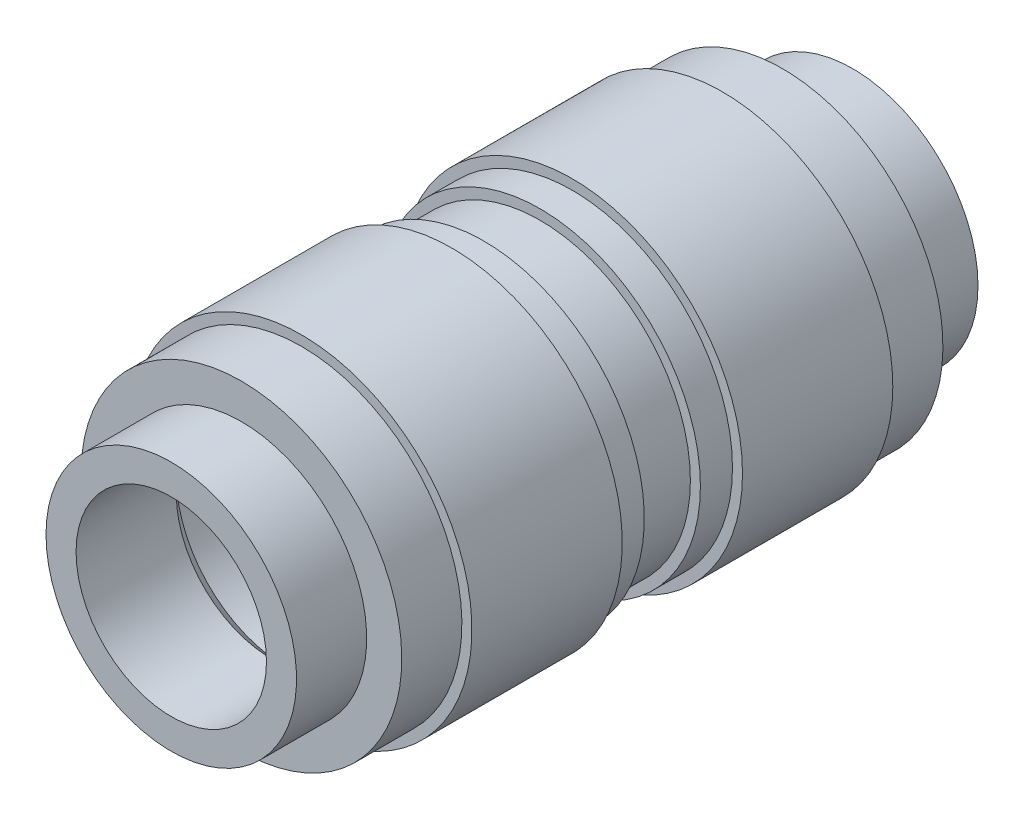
ISO-10303-21;
HEADER;
FILE_DESCRIPTION(('STEP AP214'),'2;1');
FILE_NAME('part.step','',(''),(''),'','','');
FILE_SCHEMA(('AUTOMOTIVE_DESIGN { 1 0 10303 214 1 1 1 1 }'));
ENDSEC;
DATA;
#1=APPLICATION_CONTEXT('core data for automotive mechanical design processes');
#2=APPLICATION_PROTOCOL_DEFINITION('international standard','automotive_design',2000,#1);
#3=PRODUCT_CONTEXT('',#1,'mechanical');
#4=PRODUCT('Part','Part','',(#3));
#5=PRODUCT_RELATED_PRODUCT_CATEGORY('part','',(#4));
#6=PRODUCT_DEFINITION_FORMATION('','',#4);
#7=PRODUCT_DEFINITION_CONTEXT('part definition',#1,'design');
#8=PRODUCT_DEFINITION('design','',#6,#7);
#9=PRODUCT_DEFINITION_SHAPE('','',#8);
#10=(LENGTH_UNIT() NAMED_UNIT(*) SI_UNIT(.MILLI.,.METRE.));
#11=(NAMED_UNIT(*) PLANE_ANGLE_UNIT() SI_UNIT($,.RADIAN.));
#12=(NAMED_UNIT(*) SI_UNIT($,.STERADIAN.) SOLID_ANGLE_UNIT());
#13=UNCERTAINTY_MEASURE_WITH_UNIT(LENGTH_MEASURE(1.E-05),#10,'distance_accuracy_value','');
#14=(GEOMETRIC_REPRESENTATION_CONTEXT(3) GLOBAL_UNCERTAINTY_ASSIGNED_CONTEXT((#13)) GLOBAL_UNIT_ASSIGNED_CONTEXT((#10,
#11,#12)) REPRESENTATION_CONTEXT('',''));
#15=CARTESIAN_POINT('',(0.,0.,0.));
#16=DIRECTION('',(0.,0.,1.));
#17=DIRECTION('',(1.,0.,0.));
#18=AXIS2_PLACEMENT_3D('',#15,#16,#17);
#19=CARTESIAN_POINT('',(0.,0.,-34.));
#20=DIRECTION('',(0.,0.,1.));
#21=DIRECTION('',(1.,0.,0.));
#22=AXIS2_PLACEMENT_3D('',#19,#20,#21);
#23=CYLINDRICAL_SURFACE('',#22,9.5);
#24=CARTESIAN_POINT('',(0.,0.,-34.));
#25=DIRECTION('',(0.,0.,1.));
#26=DIRECTION('',(1.,0.,0.));
#27=AXIS2_PLACEMENT_3D('',#24,#25,#26);
#28=CIRCLE('',#27,9.5);
#29=CARTESIAN_POINT('',(9.5,0.,-34.));
#30=VERTEX_POINT('',#29);
#31=EDGE_CURVE('E14',#30,#30,#28,.F.);
#32=ORIENTED_EDGE('',*,*,#31,.T.);
#33=EDGE_LOOP('',(#32));
#34=FACE_BOUND('',#33,.T.);
#35=CARTESIAN_POINT('',(0.,0.,-24.));
#36=DIRECTION('',(0.,0.,1.));
#37=DIRECTION('',(1.,0.,0.));
#38=AXIS2_PLACEMENT_3D('',#35,#36,#37);
#39=CIRCLE('',#38,9.5);
#40=CARTESIAN_POINT('',(9.5,0.,-24.));
#41=VERTEX_POINT('',#40);
#42=EDGE_CURVE('E26',#41,#41,#39,.F.);
#43=ORIENTED_EDGE('',*,*,#42,.F.);
#44=EDGE_LOOP('',(#43));
#45=FACE_BOUND('',#44,.T.);
#46=ADVANCED_FACE('F10',(#34,#45),#23,.F.);
#47=CARTESIAN_POINT('',(-12.65,-12.65,-34.));
#48=DIRECTION('',(0.,0.,1.));
#49=DIRECTION('',(1.,0.,0.));
#50=AXIS2_PLACEMENT_3D('',#47,#48,#49);
#51=PLANE('',#50);
#52=ORIENTED_EDGE('',*,*,#31,.F.);
#53=EDGE_LOOP('',(#52));
#54=FACE_BOUND('',#53,.T.);
#55=CARTESIAN_POINT('',(0.,0.,-34.));
#56=DIRECTION('',(0.,0.,1.));
#57=DIRECTION('',(1.,0.,0.));
#58=AXIS2_PLACEMENT_3D('',#55,#56,#57);
#59=CIRCLE('',#58,12.5);
#60=CARTESIAN_POINT('',(12.5,0.,-34.));
#61=VERTEX_POINT('',#60);
#62=EDGE_CURVE('E82',#61,#61,#59,.F.);
#63=ORIENTED_EDGE('',*,*,#62,.T.);
#64=EDGE_LOOP('',(#63));
#65=FACE_BOUND('',#64,.T.);
#66=ADVANCED_FACE('F95',(#54,#65),#51,.F.);
#67=CARTESIAN_POINT('',(0.,0.,-24.));
#68=DIRECTION('',(0.,0.,1.));
#69=DIRECTION('',(1.,0.,0.));
#70=AXIS2_PLACEMENT_3D('',#67,#68,#69);
#71=CONICAL_SURFACE('',#70,9.5,0.785398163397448);
#72=ORIENTED_EDGE('',*,*,#42,.T.);
#73=EDGE_LOOP('',(#72));
#74=FACE_BOUND('',#73,.T.);
#75=CARTESIAN_POINT('',(0.,0.,-22.5));
#76=DIRECTION('',(0.,0.,1.));
#77=DIRECTION('',(1.,0.,0.));
#78=AXIS2_PLACEMENT_3D('',#75,#76,#77);
#79=CIRCLE('',#78,11.);
#80=CARTESIAN_POINT('',(11.,0.,-22.5));
#81=VERTEX_POINT('',#80);
#82=EDGE_CURVE('E81',#81,#81,#79,.F.);
#83=ORIENTED_EDGE('',*,*,#82,.F.);
#84=EDGE_LOOP('',(#83));
#85=FACE_BOUND('',#84,.T.);
#86=ADVANCED_FACE('F97',(#74,#85),#71,.F.);
#87=CARTESIAN_POINT('',(0.,0.,-34.));
#88=DIRECTION('',(0.,0.,1.));
#89=DIRECTION('',(1.,0.,0.));
#90=AXIS2_PLACEMENT_3D('',#87,#88,#89);
#91=CYLINDRICAL_SURFACE('',#90,12.5);
#92=CARTESIAN_POINT('',(0.,0.,-27.));
#93=DIRECTION('',(0.,0.,1.));
#94=DIRECTION('',(1.,0.,0.));
#95=AXIS2_PLACEMENT_3D('',#92,#93,#94);
#96=CIRCLE('',#95,12.5);
#97=CARTESIAN_POINT('',(12.5,0.,-27.));
#98=VERTEX_POINT('',#97);
#99=EDGE_CURVE('E79',#98,#98,#96,.F.);
#100=ORIENTED_EDGE('',*,*,#99,.T.);
#101=EDGE_LOOP('',(#100));
#102=FACE_BOUND('',#101,.T.);
#103=ORIENTED_EDGE('',*,*,#62,.F.);
#104=EDGE_LOOP('',(#103));
#105=FACE_BOUND('',#104,.T.);
#106=ADVANCED_FACE('F102',(#102,#105),#91,.T.);
#107=CARTESIAN_POINT('',(0.,0.,-22.5));
#108=DIRECTION('',(0.,0.,1.));
#109=DIRECTION('',(1.,0.,0.));
#110=AXIS2_PLACEMENT_3D('',#107,#108,#109);
#111=CYLINDRICAL_SURFACE('',#110,11.);
#112=ORIENTED_EDGE('',*,*,#82,.T.);
#113=EDGE_LOOP('',(#112));
#114=FACE_BOUND('',#113,.T.);
#115=CARTESIAN_POINT('',(0.,0.,-5.50000000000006));
#116=DIRECTION('',(0.,0.,-1.));
#117=DIRECTION('',(-1.,0.,0.));
#118=AXIS2_PLACEMENT_3D('',#115,#116,#117);
#119=CIRCLE('',#118,11.);
#120=CARTESIAN_POINT('',(-11.,0.,-5.5));
#121=VERTEX_POINT('',#120);
#122=EDGE_CURVE('E78',#121,#121,#119,.T.);
#123=ORIENTED_EDGE('',*,*,#122,.F.);
#124=EDGE_LOOP('',(#123));
#125=FACE_BOUND('',#124,.T.);
#126=ADVANCED_FACE('F177',(#114,#125),#111,.F.);
#127=CARTESIAN_POINT('',(-16.192,-16.192,-27.));
#128=DIRECTION('',(0.,0.,1.));
#129=DIRECTION('',(1.,0.,0.));
#130=AXIS2_PLACEMENT_3D('',#127,#128,#129);
#131=PLANE('',#130);
#132=ORIENTED_EDGE('',*,*,#99,.F.);
#133=EDGE_LOOP('',(#132));
#134=FACE_BOUND('',#133,.T.);
#135=CARTESIAN_POINT('',(0.,0.,-27.));
#136=DIRECTION('',(0.,0.,1.));
#137=DIRECTION('',(0.,-1.,0.));
#138=AXIS2_PLACEMENT_3D('',#135,#136,#137);
#139=CIRCLE('',#138,16.);
#140=CARTESIAN_POINT('',(0.,-16.,-27.));
#141=VERTEX_POINT('',#140);
#142=EDGE_CURVE('E75',#141,#141,#139,.F.);
#143=ORIENTED_EDGE('',*,*,#142,.T.);
#144=EDGE_LOOP('',(#143));
#145=FACE_BOUND('',#144,.T.);
#146=ADVANCED_FACE('F175',(#134,#145),#131,.F.);
#147=CARTESIAN_POINT('',(0.,0.,-4.));
#148=DIRECTION('',(0.,0.,-1.));
#149=DIRECTION('',(-1.,0.,0.));
#150=AXIS2_PLACEMENT_3D('',#147,#148,#149);
#151=CONICAL_SURFACE('',#150,9.5,0.785398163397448);
#152=CARTESIAN_POINT('',(0.,0.,-4.));
#153=DIRECTION('',(0.,0.,1.));
#154=DIRECTION('',(1.,0.,0.));
#155=AXIS2_PLACEMENT_3D('',#152,#153,#154);
#156=CIRCLE('',#155,9.5);
#157=CARTESIAN_POINT('',(9.5,0.,-4.));
#158=VERTEX_POINT('',#157);
#159=EDGE_CURVE('E74',#158,#158,#156,.F.);
#160=ORIENTED_EDGE('',*,*,#159,.F.);
#161=EDGE_LOOP('',(#160));
#162=FACE_BOUND('',#161,.T.);
#163=ORIENTED_EDGE('',*,*,#122,.T.);
#164=EDGE_LOOP('',(#163));
#165=FACE_BOUND('',#164,.T.);
#166=ADVANCED_FACE('F171',(#162,#165),#151,.F.);
#167=CARTESIAN_POINT('',(0.,0.,-27.));
#168=DIRECTION('',(0.,0.,1.));
#169=DIRECTION('',(0.,-1.,0.));
#170=AXIS2_PLACEMENT_3D('',#167,#168,#169);
#171=CYLINDRICAL_SURFACE('',#170,16.);
#172=CARTESIAN_POINT('',(0.,0.,-21.));
#173=DIRECTION('',(0.,0.,1.));
#174=DIRECTION('',(0.,-1.,0.));
#175=AXIS2_PLACEMENT_3D('',#172,#173,#174);
#176=CIRCLE('',#175,16.);
#177=CARTESIAN_POINT('',(0.,-16.,-21.));
#178=VERTEX_POINT('',#177);
#179=EDGE_CURVE('E71',#178,#178,#176,.F.);
#180=ORIENTED_EDGE('',*,*,#179,.T.);
#181=EDGE_LOOP('',(#180));
#182=FACE_BOUND('',#181,.T.);
#183=ORIENTED_EDGE('',*,*,#142,.F.);
#184=EDGE_LOOP('',(#183));
#185=FACE_BOUND('',#184,.T.);
#186=ADVANCED_FACE('F167',(#182,#185),#171,.T.);
#187=CARTESIAN_POINT('',(0.,0.,-4.));
#188=DIRECTION('',(0.,0.,1.));
#189=DIRECTION('',(1.,0.,0.));
#190=AXIS2_PLACEMENT_3D('',#187,#188,#189);
#191=CYLINDRICAL_SURFACE('',#190,9.5);
#192=ORIENTED_EDGE('',*,*,#159,.T.);
#193=EDGE_LOOP('',(#192));
#194=FACE_BOUND('',#193,.T.);
#195=CARTESIAN_POINT('',(0.,0.,4.));
#196=DIRECTION('',(0.,0.,1.));
#197=DIRECTION('',(-1.,0.,0.));
#198=AXIS2_PLACEMENT_3D('',#195,#196,#197);
#199=CIRCLE('',#198,9.5);
#200=CARTESIAN_POINT('',(-9.5,0.,4.));
#201=VERTEX_POINT('',#200);
#202=EDGE_CURVE('E70',#201,#201,#199,.F.);
#203=ORIENTED_EDGE('',*,*,#202,.F.);
#204=EDGE_LOOP('',(#203));
#205=FACE_BOUND('',#204,.T.);
#206=ADVANCED_FACE('F164',(#194,#205),#191,.F.);
#207=CARTESIAN_POINT('',(-17.204,-17.204,-21.));
#208=DIRECTION('',(0.,0.,1.));
#209=DIRECTION('',(1.,0.,0.));
#210=AXIS2_PLACEMENT_3D('',#207,#208,#209);
#211=PLANE('',#210);
#212=ORIENTED_EDGE('',*,*,#179,.F.);
#213=EDGE_LOOP('',(#212));
#214=FACE_BOUND('',#213,.T.);
#215=CARTESIAN_POINT('',(0.,0.,-21.));
#216=DIRECTION('',(0.,0.,1.));
#217=DIRECTION('',(1.,0.,0.));
#218=AXIS2_PLACEMENT_3D('',#215,#216,#217);
#219=CIRCLE('',#218,17.);
#220=CARTESIAN_POINT('',(17.,0.,-21.));
#221=VERTEX_POINT('',#220);
#222=EDGE_CURVE('E67',#221,#221,#219,.F.);
#223=ORIENTED_EDGE('',*,*,#222,.T.);
#224=EDGE_LOOP('',(#223));
#225=FACE_BOUND('',#224,.T.);
#226=ADVANCED_FACE('F162',(#214,#225),#211,.F.);
#227=CARTESIAN_POINT('',(0.,0.,4.));
#228=DIRECTION('',(0.,0.,1.));
#229=DIRECTION('',(1.,0.,0.));
#230=AXIS2_PLACEMENT_3D('',#227,#228,#229);
#231=CONICAL_SURFACE('',#230,9.5,0.785398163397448);
#232=CARTESIAN_POINT('',(0.,0.,5.5));
#233=DIRECTION('',(0.,0.,-1.));
#234=DIRECTION('',(1.,0.,0.));
#235=AXIS2_PLACEMENT_3D('',#232,#233,#234);
#236=CIRCLE('',#235,11.);
#237=CARTESIAN_POINT('',(11.,0.,5.5));
#238=VERTEX_POINT('',#237);
#239=EDGE_CURVE('E66',#238,#238,#236,.T.);
#240=ORIENTED_EDGE('',*,*,#239,.F.);
#241=EDGE_LOOP('',(#240));
#242=FACE_BOUND('',#241,.T.);
#243=ORIENTED_EDGE('',*,*,#202,.T.);
#244=EDGE_LOOP('',(#243));
#245=FACE_BOUND('',#244,.T.);
#246=ADVANCED_FACE('F158',(#242,#245),#231,.F.);
#247=CARTESIAN_POINT('',(0.,0.,-21.));
#248=DIRECTION('',(0.,0.,1.));
#249=DIRECTION('',(1.,0.,0.));
#250=AXIS2_PLACEMENT_3D('',#247,#248,#249);
#251=CYLINDRICAL_SURFACE('',#250,17.);
#252=CARTESIAN_POINT('',(0.,0.,-6.));
#253=DIRECTION('',(0.,0.,1.));
#254=DIRECTION('',(1.,0.,0.));
#255=AXIS2_PLACEMENT_3D('',#252,#253,#254);
#256=CIRCLE('',#255,17.);
#257=CARTESIAN_POINT('',(17.,0.,-6.));
#258=VERTEX_POINT('',#257);
#259=EDGE_CURVE('E63',#258,#258,#256,.F.);
#260=ORIENTED_EDGE('',*,*,#259,.T.);
#261=EDGE_LOOP('',(#260));
#262=FACE_BOUND('',#261,.T.);
#263=ORIENTED_EDGE('',*,*,#222,.F.);
#264=EDGE_LOOP('',(#263));
#265=FACE_BOUND('',#264,.T.);
#266=ADVANCED_FACE('F154',(#262,#265),#251,.T.);
#267=CARTESIAN_POINT('',(0.,0.,22.5));
#268=DIRECTION('',(0.,0.,-1.));
#269=DIRECTION('',(-1.,0.,0.));
#270=AXIS2_PLACEMENT_3D('',#267,#268,#269);
#271=CYLINDRICAL_SURFACE('',#270,11.);
#272=ORIENTED_EDGE('',*,*,#239,.T.);
#273=EDGE_LOOP('',(#272));
#274=FACE_BOUND('',#273,.T.);
#275=CARTESIAN_POINT('',(0.,0.,22.5));
#276=DIRECTION('',(0.,0.,-1.));
#277=DIRECTION('',(1.,0.,0.));
#278=AXIS2_PLACEMENT_3D('',#275,#276,#277);
#279=CIRCLE('',#278,11.);
#280=CARTESIAN_POINT('',(11.,0.,22.5));
#281=VERTEX_POINT('',#280);
#282=EDGE_CURVE('E62',#281,#281,#279,.T.);
#283=ORIENTED_EDGE('',*,*,#282,.F.);
#284=EDGE_LOOP('',(#283));
#285=FACE_BOUND('',#284,.T.);
#286=ADVANCED_FACE('F151',(#274,#285),#271,.F.);
#287=CARTESIAN_POINT('',(17.204,-17.204,-6.));
#288=DIRECTION('',(0.,0.,-1.));
#289=DIRECTION('',(-1.,0.,0.));
#290=AXIS2_PLACEMENT_3D('',#287,#288,#289);
#291=PLANE('',#290);
#292=CARTESIAN_POINT('',(0.,0.,-6.));
#293=DIRECTION('',(0.,0.,1.));
#294=DIRECTION('',(1.,0.,0.));
#295=AXIS2_PLACEMENT_3D('',#292,#293,#294);
#296=CIRCLE('',#295,16.);
#297=CARTESIAN_POINT('',(16.,0.,-6.));
#298=VERTEX_POINT('',#297);
#299=EDGE_CURVE('E59',#298,#298,#296,.F.);
#300=ORIENTED_EDGE('',*,*,#299,.T.);
#301=EDGE_LOOP('',(#300));
#302=FACE_BOUND('',#301,.T.);
#303=ORIENTED_EDGE('',*,*,#259,.F.);
#304=EDGE_LOOP('',(#303));
#305=FACE_BOUND('',#304,.T.);
#306=ADVANCED_FACE('F149',(#302,#305),#291,.F.);
#307=CARTESIAN_POINT('',(0.,0.,24.));
#308=DIRECTION('',(0.,0.,-1.));
#309=DIRECTION('',(-1.,0.,0.));
#310=AXIS2_PLACEMENT_3D('',#307,#308,#309);
#311=CONICAL_SURFACE('',#310,9.5,0.785398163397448);
#312=ORIENTED_EDGE('',*,*,#282,.T.);
#313=EDGE_LOOP('',(#312));
#314=FACE_BOUND('',#313,.T.);
#315=CARTESIAN_POINT('',(0.,0.,24.));
#316=DIRECTION('',(0.,0.,-1.));
#317=DIRECTION('',(1.,0.,0.));
#318=AXIS2_PLACEMENT_3D('',#315,#316,#317);
#319=CIRCLE('',#318,9.5);
#320=CARTESIAN_POINT('',(9.5,0.,24.));
#321=VERTEX_POINT('',#320);
#322=EDGE_CURVE('E58',#321,#321,#319,.T.);
#323=ORIENTED_EDGE('',*,*,#322,.F.);
#324=EDGE_LOOP('',(#323));
#325=FACE_BOUND('',#324,.T.);
#326=ADVANCED_FACE('F145',(#314,#325),#311,.F.);
#327=CARTESIAN_POINT('',(0.,0.,-6.));
#328=DIRECTION('',(0.,0.,1.));
#329=DIRECTION('',(1.,0.,0.));
#330=AXIS2_PLACEMENT_3D('',#327,#328,#329);
#331=CYLINDRICAL_SURFACE('',#330,16.);
#332=ORIENTED_EDGE('',*,*,#299,.F.);
#333=EDGE_LOOP('',(#332));
#334=FACE_BOUND('',#333,.T.);
#335=CARTESIAN_POINT('',(0.,0.,-2.8));
#336=DIRECTION('',(0.,0.,1.));
#337=DIRECTION('',(1.,0.,0.));
#338=AXIS2_PLACEMENT_3D('',#335,#336,#337);
#339=CIRCLE('',#338,16.);
#340=CARTESIAN_POINT('',(16.,0.,-2.8));
#341=VERTEX_POINT('',#340);
#342=EDGE_CURVE('E55',#341,#341,#339,.T.);
#343=ORIENTED_EDGE('',*,*,#342,.F.);
#344=EDGE_LOOP('',(#343));
#345=FACE_BOUND('',#344,.T.);
#346=ADVANCED_FACE('F141',(#334,#345),#331,.T.);
#347=CARTESIAN_POINT('',(0.,0.,34.));
#348=DIRECTION('',(0.,0.,-1.));
#349=DIRECTION('',(-1.,0.,0.));
#350=AXIS2_PLACEMENT_3D('',#347,#348,#349);
#351=CYLINDRICAL_SURFACE('',#350,9.5);
#352=ORIENTED_EDGE('',*,*,#322,.T.);
#353=EDGE_LOOP('',(#352));
#354=FACE_BOUND('',#353,.T.);
#355=CARTESIAN_POINT('',(0.,0.,34.));
#356=DIRECTION('',(0.,0.,-1.));
#357=DIRECTION('',(-1.,0.,0.));
#358=AXIS2_PLACEMENT_3D('',#355,#356,#357);
#359=CIRCLE('',#358,9.5);
#360=CARTESIAN_POINT('',(-9.5,0.,34.));
#361=VERTEX_POINT('',#360);
#362=EDGE_CURVE('E52',#361,#361,#359,.F.);
#363=ORIENTED_EDGE('',*,*,#362,.T.);
#364=EDGE_LOOP('',(#363));
#365=FACE_BOUND('',#364,.T.);
#366=ADVANCED_FACE('F137',(#354,#365),#351,.F.);
#367=CARTESIAN_POINT('',(-16.192,-16.192,-2.8));
#368=DIRECTION('',(0.,0.,1.));
#369=DIRECTION('',(1.,0.,0.));
#370=AXIS2_PLACEMENT_3D('',#367,#368,#369);
#371=PLANE('',#370);
#372=CARTESIAN_POINT('',(0.,0.,-2.8));
#373=DIRECTION('',(0.,0.,1.));
#374=DIRECTION('',(1.,0.,0.));
#375=AXIS2_PLACEMENT_3D('',#372,#373,#374);
#376=CIRCLE('',#375,15.);
#377=CARTESIAN_POINT('',(15.,0.,-2.8));
#378=VERTEX_POINT('',#377);
#379=EDGE_CURVE('E49',#378,#378,#376,.F.);
#380=ORIENTED_EDGE('',*,*,#379,.T.);
#381=EDGE_LOOP('',(#380));
#382=FACE_BOUND('',#381,.T.);
#383=ORIENTED_EDGE('',*,*,#342,.T.);
#384=EDGE_LOOP('',(#383));
#385=FACE_BOUND('',#384,.T.);
#386=ADVANCED_FACE('F140',(#382,#385),#371,.T.);
#387=CARTESIAN_POINT('',(-12.65,12.65,34.));
#388=DIRECTION('',(0.,0.,-1.));
#389=DIRECTION('',(1.,0.,0.));
#390=AXIS2_PLACEMENT_3D('',#387,#388,#389);
#391=PLANE('',#390);
#392=ORIENTED_EDGE('',*,*,#362,.F.);
#393=EDGE_LOOP('',(#392));
#394=FACE_BOUND('',#393,.T.);
#395=CARTESIAN_POINT('',(0.,0.,34.));
#396=DIRECTION('',(0.,0.,-1.));
#397=DIRECTION('',(-1.,0.,0.));
#398=AXIS2_PLACEMENT_3D('',#395,#396,#397);
#399=CIRCLE('',#398,12.5);
#400=CARTESIAN_POINT('',(-12.5,0.,34.));
#401=VERTEX_POINT('',#400);
#402=EDGE_CURVE('E46',#401,#401,#399,.F.);
#403=ORIENTED_EDGE('',*,*,#402,.T.);
#404=EDGE_LOOP('',(#403));
#405=FACE_BOUND('',#404,.T.);
#406=ADVANCED_FACE('F135',(#394,#405),#391,.F.);
#407=CARTESIAN_POINT('',(0.,0.,-2.8));
#408=DIRECTION('',(0.,0.,1.));
#409=DIRECTION('',(1.,0.,0.));
#410=AXIS2_PLACEMENT_3D('',#407,#408,#409);
#411=CYLINDRICAL_SURFACE('',#410,15.);
#412=ORIENTED_EDGE('',*,*,#379,.F.);
#413=EDGE_LOOP('',(#412));
#414=FACE_BOUND('',#413,.T.);
#415=CARTESIAN_POINT('',(0.,0.,2.8));
#416=DIRECTION('',(0.,0.,1.));
#417=DIRECTION('',(1.,0.,0.));
#418=AXIS2_PLACEMENT_3D('',#415,#416,#417);
#419=CIRCLE('',#418,15.);
#420=CARTESIAN_POINT('',(15.,0.,2.8));
#421=VERTEX_POINT('',#420);
#422=EDGE_CURVE('E43',#421,#421,#419,.T.);
#423=ORIENTED_EDGE('',*,*,#422,.F.);
#424=EDGE_LOOP('',(#423));
#425=FACE_BOUND('',#424,.T.);
#426=ADVANCED_FACE('F131',(#414,#425),#411,.T.);
#427=CARTESIAN_POINT('',(0.,0.,34.));
#428=DIRECTION('',(0.,0.,-1.));
#429=DIRECTION('',(-1.,0.,0.));
#430=AXIS2_PLACEMENT_3D('',#427,#428,#429);
#431=CYLINDRICAL_SURFACE('',#430,12.5);
#432=ORIENTED_EDGE('',*,*,#402,.F.);
#433=EDGE_LOOP('',(#432));
#434=FACE_BOUND('',#433,.T.);
#435=CARTESIAN_POINT('',(0.,0.,27.));
#436=DIRECTION('',(0.,0.,-1.));
#437=DIRECTION('',(-1.,0.,0.));
#438=AXIS2_PLACEMENT_3D('',#435,#436,#437);
#439=CIRCLE('',#438,12.5);
#440=CARTESIAN_POINT('',(-12.5,0.,27.));
#441=VERTEX_POINT('',#440);
#442=EDGE_CURVE('E40',#441,#441,#439,.F.);
#443=ORIENTED_EDGE('',*,*,#442,.T.);
#444=EDGE_LOOP('',(#443));
#445=FACE_BOUND('',#444,.T.);
#446=ADVANCED_FACE('F127',(#434,#445),#431,.T.);
#447=CARTESIAN_POINT('',(-16.192,16.192,2.8));
#448=DIRECTION('',(0.,0.,-1.));
#449=DIRECTION('',(1.,0.,0.));
#450=AXIS2_PLACEMENT_3D('',#447,#448,#449);
#451=PLANE('',#450);
#452=ORIENTED_EDGE('',*,*,#422,.T.);
#453=EDGE_LOOP('',(#452));
#454=FACE_BOUND('',#453,.T.);
#455=CARTESIAN_POINT('',(0.,0.,2.8));
#456=DIRECTION('',(0.,0.,-1.));
#457=DIRECTION('',(-1.,0.,0.));
#458=AXIS2_PLACEMENT_3D('',#455,#456,#457);
#459=CIRCLE('',#458,16.);
#460=CARTESIAN_POINT('',(-16.,0.,2.8));
#461=VERTEX_POINT('',#460);
#462=EDGE_CURVE('E37',#461,#461,#459,.T.);
#463=ORIENTED_EDGE('',*,*,#462,.T.);
#464=EDGE_LOOP('',(#463));
#465=FACE_BOUND('',#464,.T.);
#466=ADVANCED_FACE('F130',(#454,#465),#451,.T.);
#467=CARTESIAN_POINT('',(-16.192,16.192,27.));
#468=DIRECTION('',(0.,0.,-1.));
#469=DIRECTION('',(1.,0.,0.));
#470=AXIS2_PLACEMENT_3D('',#467,#468,#469);
#471=PLANE('',#470);
#472=ORIENTED_EDGE('',*,*,#442,.F.);
#473=EDGE_LOOP('',(#472));
#474=FACE_BOUND('',#473,.T.);
#475=CARTESIAN_POINT('',(0.,0.,27.));
#476=DIRECTION('',(0.,0.,-1.));
#477=DIRECTION('',(0.,1.,0.));
#478=AXIS2_PLACEMENT_3D('',#475,#476,#477);
#479=CIRCLE('',#478,16.);
#480=CARTESIAN_POINT('',(0.,16.,27.));
#481=VERTEX_POINT('',#480);
#482=EDGE_CURVE('E34',#481,#481,#479,.F.);
#483=ORIENTED_EDGE('',*,*,#482,.T.);
#484=EDGE_LOOP('',(#483));
#485=FACE_BOUND('',#484,.T.);
#486=ADVANCED_FACE('F125',(#474,#485),#471,.F.);
#487=CARTESIAN_POINT('',(0.,0.,6.));
#488=DIRECTION('',(0.,0.,-1.));
#489=DIRECTION('',(-1.,0.,0.));
#490=AXIS2_PLACEMENT_3D('',#487,#488,#489);
#491=CYLINDRICAL_SURFACE('',#490,16.);
#492=CARTESIAN_POINT('',(0.,0.,6.));
#493=DIRECTION('',(0.,0.,-1.));
#494=DIRECTION('',(-1.,0.,0.));
#495=AXIS2_PLACEMENT_3D('',#492,#493,#494);
#496=CIRCLE('',#495,16.);
#497=CARTESIAN_POINT('',(-16.,0.,6.));
#498=VERTEX_POINT('',#497);
#499=EDGE_CURVE('E31',#498,#498,#496,.T.);
#500=ORIENTED_EDGE('',*,*,#499,.T.);
#501=EDGE_LOOP('',(#500));
#502=FACE_BOUND('',#501,.T.);
#503=ORIENTED_EDGE('',*,*,#462,.F.);
#504=EDGE_LOOP('',(#503));
#505=FACE_BOUND('',#504,.T.);
#506=ADVANCED_FACE('F121',(#502,#505),#491,.T.);
#507=CARTESIAN_POINT('',(0.,0.,27.));
#508=DIRECTION('',(0.,0.,-1.));
#509=DIRECTION('',(0.,1.,0.));
#510=AXIS2_PLACEMENT_3D('',#507,#508,#509);
#511=CYLINDRICAL_SURFACE('',#510,16.);
#512=ORIENTED_EDGE('',*,*,#482,.F.);
#513=EDGE_LOOP('',(#512));
#514=FACE_BOUND('',#513,.T.);
#515=CARTESIAN_POINT('',(0.,0.,21.));
#516=DIRECTION('',(0.,0.,-1.));
#517=DIRECTION('',(0.,1.,0.));
#518=AXIS2_PLACEMENT_3D('',#515,#516,#517);
#519=CIRCLE('',#518,16.);
#520=CARTESIAN_POINT('',(0.,16.,21.));
#521=VERTEX_POINT('',#520);
#522=EDGE_CURVE('E23',#521,#521,#519,.F.);
#523=ORIENTED_EDGE('',*,*,#522,.T.);
#524=EDGE_LOOP('',(#523));
#525=FACE_BOUND('',#524,.T.);
#526=ADVANCED_FACE('F118',(#514,#525),#511,.T.);
#527=CARTESIAN_POINT('',(17.204,17.204,6.));
#528=DIRECTION('',(0.,0.,1.));
#529=DIRECTION('',(-1.,0.,0.));
#530=AXIS2_PLACEMENT_3D('',#527,#528,#529);
#531=PLANE('',#530);
#532=ORIENTED_EDGE('',*,*,#499,.F.);
#533=EDGE_LOOP('',(#532));
#534=FACE_BOUND('',#533,.T.);
#535=CARTESIAN_POINT('',(0.,0.,6.));
#536=DIRECTION('',(0.,0.,-1.));
#537=DIRECTION('',(-1.,0.,0.));
#538=AXIS2_PLACEMENT_3D('',#535,#536,#537);
#539=CIRCLE('',#538,17.);
#540=CARTESIAN_POINT('',(-17.,0.,6.));
#541=VERTEX_POINT('',#540);
#542=EDGE_CURVE('E18',#541,#541,#539,.T.);
#543=ORIENTED_EDGE('',*,*,#542,.T.);
#544=EDGE_LOOP('',(#543));
#545=FACE_BOUND('',#544,.T.);
#546=ADVANCED_FACE('F113',(#534,#545),#531,.F.);
#547=CARTESIAN_POINT('',(-17.204,17.204,21.));
#548=DIRECTION('',(0.,0.,-1.));
#549=DIRECTION('',(1.,0.,0.));
#550=AXIS2_PLACEMENT_3D('',#547,#548,#549);
#551=PLANE('',#550);
#552=ORIENTED_EDGE('',*,*,#522,.F.);
#553=EDGE_LOOP('',(#552));
#554=FACE_BOUND('',#553,.T.);
#555=CARTESIAN_POINT('',(0.,0.,21.));
#556=DIRECTION('',(0.,0.,-1.));
#557=DIRECTION('',(-1.,0.,0.));
#558=AXIS2_PLACEMENT_3D('',#555,#556,#557);
#559=CIRCLE('',#558,17.);
#560=CARTESIAN_POINT('',(-17.,0.,21.));
#561=VERTEX_POINT('',#560);
#562=EDGE_CURVE('E8',#561,#561,#559,.F.);
#563=ORIENTED_EDGE('',*,*,#562,.T.);
#564=EDGE_LOOP('',(#563));
#565=FACE_BOUND('',#564,.T.);
#566=ADVANCED_FACE('F12',(#554,#565),#551,.F.);
#567=CARTESIAN_POINT('',(0.,0.,21.));
#568=DIRECTION('',(0.,0.,-1.));
#569=DIRECTION('',(-1.,0.,0.));
#570=AXIS2_PLACEMENT_3D('',#567,#568,#569);
#571=CYLINDRICAL_SURFACE('',#570,17.);
#572=ORIENTED_EDGE('',*,*,#542,.F.);
#573=EDGE_LOOP('',(#572));
#574=FACE_BOUND('',#573,.T.);
#575=ORIENTED_EDGE('',*,*,#562,.F.);
#576=EDGE_LOOP('',(#575));
#577=FACE_BOUND('',#576,.T.);
#578=ADVANCED_FACE('F108',(#574,#577),#571,.T.);
#579=CLOSED_SHELL('',(#46,#66,#86,#106,#126,#146,#166,#186,#206,#226,#246,#266,#286,#306,#326,
#346,#366,#386,#406,#426,#446,#466,#486,#506,#526,#546,#566,#578));
#580=MANIFOLD_SOLID_BREP('B1',#579);
#581=ADVANCED_BREP_SHAPE_REPRESENTATION('',(#18,#580),#14);
#582=SHAPE_DEFINITION_REPRESENTATION(#9,#581);
ENDSEC;
END-ISO-10303-21;
